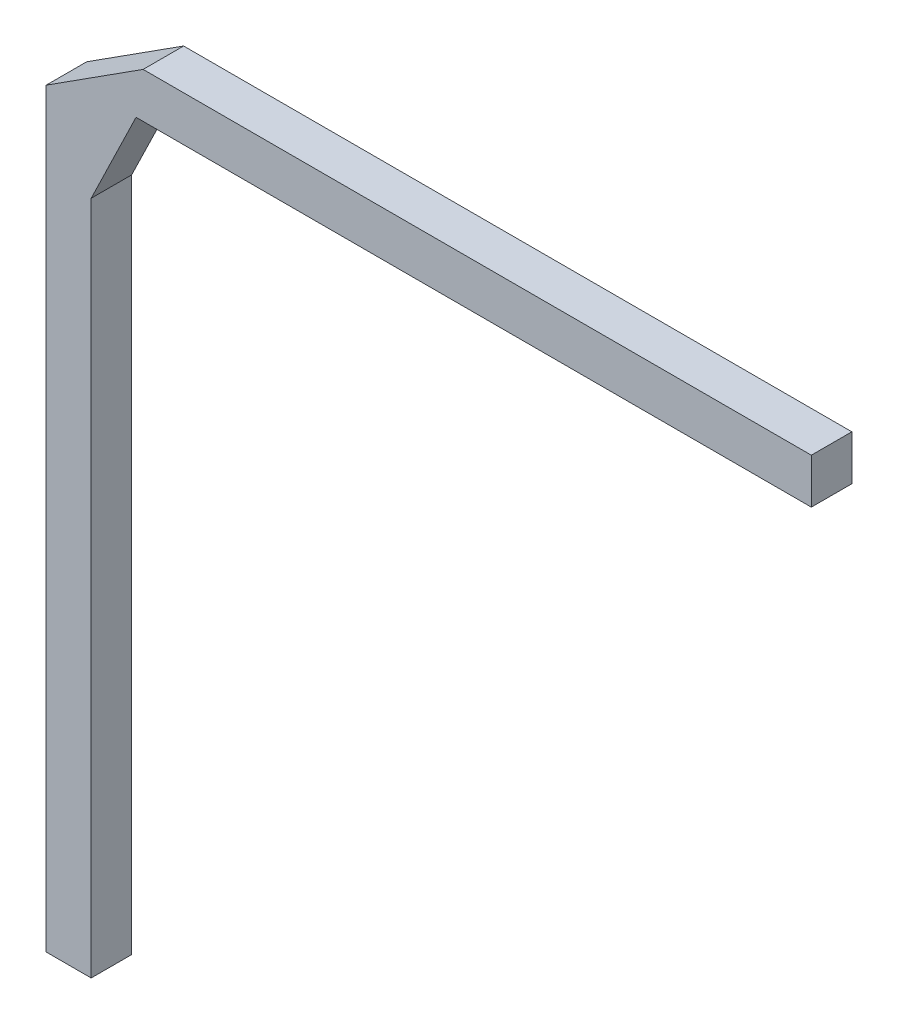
ISO-10303-21;
HEADER;
FILE_DESCRIPTION(('STEP AP214'),'2;1');
FILE_NAME('part.step','',(''),(''),'','','');
FILE_SCHEMA(('AUTOMOTIVE_DESIGN { 1 0 10303 214 1 1 1 1 }'));
ENDSEC;
DATA;
#1=APPLICATION_CONTEXT('core data for automotive mechanical design processes');
#2=APPLICATION_PROTOCOL_DEFINITION('international standard','automotive_design',2000,#1);
#3=PRODUCT_CONTEXT('',#1,'mechanical');
#4=PRODUCT('Part','Part','',(#3));
#5=PRODUCT_RELATED_PRODUCT_CATEGORY('part','',(#4));
#6=PRODUCT_DEFINITION_FORMATION('','',#4);
#7=PRODUCT_DEFINITION_CONTEXT('part definition',#1,'design');
#8=PRODUCT_DEFINITION('design','',#6,#7);
#9=PRODUCT_DEFINITION_SHAPE('','',#8);
#10=(LENGTH_UNIT() NAMED_UNIT(*) SI_UNIT(.MILLI.,.METRE.));
#11=(NAMED_UNIT(*) PLANE_ANGLE_UNIT() SI_UNIT($,.RADIAN.));
#12=(NAMED_UNIT(*) SI_UNIT($,.STERADIAN.) SOLID_ANGLE_UNIT());
#13=UNCERTAINTY_MEASURE_WITH_UNIT(LENGTH_MEASURE(1.E-05),#10,'distance_accuracy_value','');
#14=(GEOMETRIC_REPRESENTATION_CONTEXT(3) GLOBAL_UNCERTAINTY_ASSIGNED_CONTEXT((#13)) GLOBAL_UNIT_ASSIGNED_CONTEXT((#10,
#11,#12)) REPRESENTATION_CONTEXT('',''));
#15=CARTESIAN_POINT('',(0.,0.,0.));
#16=DIRECTION('',(0.,0.,1.));
#17=DIRECTION('',(1.,0.,0.));
#18=AXIS2_PLACEMENT_3D('',#15,#16,#17);
#19=CARTESIAN_POINT('',(7.95384926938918,14.8754782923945,0.9));
#20=DIRECTION('',(1.,0.,0.));
#21=DIRECTION('',(0.,1.,0.));
#22=AXIS2_PLACEMENT_3D('',#19,#20,#21);
#23=PLANE('',#22);
#24=DIRECTION('',(0.,-1.,0.));
#25=VECTOR('',#24,1.);
#26=CARTESIAN_POINT('',(7.95384926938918,14.8754782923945,0.));
#27=LINE('',#26,#25);
#28=CARTESIAN_POINT('',(7.95384926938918,14.8754782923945,0.));
#29=VERTEX_POINT('',#28);
#30=CARTESIAN_POINT('',(7.95384926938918,-1.8,0.));
#31=VERTEX_POINT('',#30);
#32=EDGE_CURVE('E141',#29,#31,#27,.T.);
#33=ORIENTED_EDGE('',*,*,#32,.T.);
#34=DIRECTION('',(0.,0.,-1.));
#35=VECTOR('',#34,1.);
#36=CARTESIAN_POINT('',(7.95384926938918,-1.8,0.9));
#37=LINE('',#36,#35);
#38=CARTESIAN_POINT('',(7.95384926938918,-1.8,0.9));
#39=VERTEX_POINT('',#38);
#40=EDGE_CURVE('E11',#39,#31,#37,.T.);
#41=ORIENTED_EDGE('',*,*,#40,.F.);
#42=DIRECTION('',(0.,-1.,0.));
#43=VECTOR('',#42,1.);
#44=CARTESIAN_POINT('',(7.95384926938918,14.8754782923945,0.9));
#45=LINE('',#44,#43);
#46=CARTESIAN_POINT('',(7.95384926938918,14.8754782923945,0.9));
#47=VERTEX_POINT('',#46);
#48=EDGE_CURVE('E163',#47,#39,#45,.T.);
#49=ORIENTED_EDGE('',*,*,#48,.F.);
#50=DIRECTION('',(0.,0.,-1.));
#51=VECTOR('',#50,1.);
#52=CARTESIAN_POINT('',(7.95384926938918,14.8754782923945,0.9));
#53=LINE('',#52,#51);
#54=EDGE_CURVE('E137',#47,#29,#53,.T.);
#55=ORIENTED_EDGE('',*,*,#54,.T.);
#56=EDGE_LOOP('',(#33,#41,#49,#55));
#57=FACE_BOUND('',#56,.T.);
#58=ADVANCED_FACE('F38',(#57),#23,.F.);
#59=CARTESIAN_POINT('',(7.95384926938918,-1.8,0.9));
#60=DIRECTION('',(0.,1.,0.));
#61=DIRECTION('',(0.,0.,1.));
#62=AXIS2_PLACEMENT_3D('',#59,#60,#61);
#63=PLANE('',#62);
#64=DIRECTION('',(1.,0.,0.));
#65=VECTOR('',#64,1.);
#66=CARTESIAN_POINT('',(7.95384926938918,-1.8,0.));
#67=LINE('',#66,#65);
#68=CARTESIAN_POINT('',(8.95384926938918,-1.8,0.));
#69=VERTEX_POINT('',#68);
#70=EDGE_CURVE('E145',#31,#69,#67,.T.);
#71=ORIENTED_EDGE('',*,*,#70,.T.);
#72=DIRECTION('',(0.,0.,-1.));
#73=VECTOR('',#72,1.);
#74=CARTESIAN_POINT('',(8.95384926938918,-1.8,0.9));
#75=LINE('',#74,#73);
#76=CARTESIAN_POINT('',(8.95384926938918,-1.8,0.9));
#77=VERTEX_POINT('',#76);
#78=EDGE_CURVE('E47',#77,#69,#75,.T.);
#79=ORIENTED_EDGE('',*,*,#78,.F.);
#80=DIRECTION('',(1.,0.,0.));
#81=VECTOR('',#80,1.);
#82=CARTESIAN_POINT('',(7.95384926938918,-1.8,0.9));
#83=LINE('',#82,#81);
#84=EDGE_CURVE('E98',#39,#77,#83,.T.);
#85=ORIENTED_EDGE('',*,*,#84,.F.);
#86=ORIENTED_EDGE('',*,*,#40,.T.);
#87=EDGE_LOOP('',(#71,#79,#85,#86));
#88=FACE_BOUND('',#87,.T.);
#89=ADVANCED_FACE('F207',(#88),#63,.F.);
#90=CARTESIAN_POINT('',(8.95384926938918,-1.8,0.9));
#91=DIRECTION('',(-1.,0.,0.));
#92=DIRECTION('',(0.,0.,1.));
#93=AXIS2_PLACEMENT_3D('',#90,#91,#92);
#94=PLANE('',#93);
#95=DIRECTION('',(0.,1.,0.));
#96=VECTOR('',#95,1.);
#97=CARTESIAN_POINT('',(8.95384926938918,-1.8,0.));
#98=LINE('',#97,#96);
#99=CARTESIAN_POINT('',(8.95384926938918,13.2,0.));
#100=VERTEX_POINT('',#99);
#101=EDGE_CURVE('E148',#69,#100,#98,.T.);
#102=ORIENTED_EDGE('',*,*,#101,.T.);
#103=DIRECTION('',(0.,0.,-1.));
#104=VECTOR('',#103,1.);
#105=CARTESIAN_POINT('',(8.95384926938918,13.2,0.9));
#106=LINE('',#105,#104);
#107=CARTESIAN_POINT('',(8.95384926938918,13.2,0.9));
#108=VERTEX_POINT('',#107);
#109=EDGE_CURVE('E172',#108,#100,#106,.T.);
#110=ORIENTED_EDGE('',*,*,#109,.F.);
#111=DIRECTION('',(0.,1.,0.));
#112=VECTOR('',#111,1.);
#113=CARTESIAN_POINT('',(8.95384926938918,-1.8,0.9));
#114=LINE('',#113,#112);
#115=EDGE_CURVE('E183',#77,#108,#114,.T.);
#116=ORIENTED_EDGE('',*,*,#115,.F.);
#117=ORIENTED_EDGE('',*,*,#78,.T.);
#118=EDGE_LOOP('',(#102,#110,#116,#117));
#119=FACE_BOUND('',#118,.T.);
#120=ADVANCED_FACE('F181',(#119),#94,.F.);
#121=CARTESIAN_POINT('',(8.95384926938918,13.2,0.9));
#122=DIRECTION('',(-0.8997865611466,0.436330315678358,0.));
#123=DIRECTION('',(-0.436330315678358,-0.8997865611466,0.));
#124=AXIS2_PLACEMENT_3D('',#121,#122,#123);
#125=PLANE('',#124);
#126=DIRECTION('',(0.436330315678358,0.8997865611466,0.));
#127=VECTOR('',#126,1.);
#128=CARTESIAN_POINT('',(8.95384926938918,13.2,0.));
#129=LINE('',#128,#127);
#130=CARTESIAN_POINT('',(9.95081427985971,15.2559096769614,0.));
#131=VERTEX_POINT('',#130);
#132=EDGE_CURVE('E151',#100,#131,#129,.T.);
#133=ORIENTED_EDGE('',*,*,#132,.T.);
#134=DIRECTION('',(0.,0.,-1.));
#135=VECTOR('',#134,1.);
#136=CARTESIAN_POINT('',(9.95081427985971,15.2559096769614,0.9));
#137=LINE('',#136,#135);
#138=CARTESIAN_POINT('',(9.95081427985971,15.2559096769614,0.9));
#139=VERTEX_POINT('',#138);
#140=EDGE_CURVE('E168',#139,#131,#137,.T.);
#141=ORIENTED_EDGE('',*,*,#140,.F.);
#142=DIRECTION('',(0.436330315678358,0.8997865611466,0.));
#143=VECTOR('',#142,1.);
#144=CARTESIAN_POINT('',(8.95384926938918,13.2,0.9));
#145=LINE('',#144,#143);
#146=EDGE_CURVE('E195',#108,#139,#145,.T.);
#147=ORIENTED_EDGE('',*,*,#146,.F.);
#148=ORIENTED_EDGE('',*,*,#109,.T.);
#149=EDGE_LOOP('',(#133,#141,#147,#148));
#150=FACE_BOUND('',#149,.T.);
#151=ADVANCED_FACE('F191',(#150),#125,.F.);
#152=CARTESIAN_POINT('',(9.95081427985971,15.2559096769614,0.9));
#153=DIRECTION('',(0.,1.,0.));
#154=DIRECTION('',(-1.,0.,0.));
#155=AXIS2_PLACEMENT_3D('',#152,#153,#154);
#156=PLANE('',#155);
#157=DIRECTION('',(1.,0.,0.));
#158=VECTOR('',#157,1.);
#159=CARTESIAN_POINT('',(9.95081427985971,15.2559096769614,0.));
#160=LINE('',#159,#158);
#161=CARTESIAN_POINT('',(24.9508142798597,15.2559096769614,0.));
#162=VERTEX_POINT('',#161);
#163=EDGE_CURVE('E154',#131,#162,#160,.T.);
#164=ORIENTED_EDGE('',*,*,#163,.T.);
#165=DIRECTION('',(0.,0.,-1.));
#166=VECTOR('',#165,1.);
#167=CARTESIAN_POINT('',(24.9508142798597,15.2559096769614,0.9));
#168=LINE('',#167,#166);
#169=CARTESIAN_POINT('',(24.9508142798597,15.2559096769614,0.9));
#170=VERTEX_POINT('',#169);
#171=EDGE_CURVE('E128',#170,#162,#168,.T.);
#172=ORIENTED_EDGE('',*,*,#171,.F.);
#173=DIRECTION('',(1.,0.,0.));
#174=VECTOR('',#173,1.);
#175=CARTESIAN_POINT('',(9.95081427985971,15.2559096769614,0.9));
#176=LINE('',#175,#174);
#177=EDGE_CURVE('E117',#139,#170,#176,.T.);
#178=ORIENTED_EDGE('',*,*,#177,.F.);
#179=ORIENTED_EDGE('',*,*,#140,.T.);
#180=EDGE_LOOP('',(#164,#172,#178,#179));
#181=FACE_BOUND('',#180,.T.);
#182=ADVANCED_FACE('F194',(#181),#156,.F.);
#183=CARTESIAN_POINT('',(24.9508142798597,15.2559096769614,0.9));
#184=DIRECTION('',(-1.,0.,0.));
#185=DIRECTION('',(0.,0.,1.));
#186=AXIS2_PLACEMENT_3D('',#183,#184,#185);
#187=PLANE('',#186);
#188=DIRECTION('',(0.,1.,0.));
#189=VECTOR('',#188,1.);
#190=CARTESIAN_POINT('',(24.9508142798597,15.2559096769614,0.));
#191=LINE('',#190,#189);
#192=CARTESIAN_POINT('',(24.9508142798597,16.2559096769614,0.));
#193=VERTEX_POINT('',#192);
#194=EDGE_CURVE('E126',#162,#193,#191,.T.);
#195=ORIENTED_EDGE('',*,*,#194,.T.);
#196=DIRECTION('',(0.,0.,-1.));
#197=VECTOR('',#196,1.);
#198=CARTESIAN_POINT('',(24.9508142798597,16.2559096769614,0.9));
#199=LINE('',#198,#197);
#200=CARTESIAN_POINT('',(24.9508142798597,16.2559096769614,0.9));
#201=VERTEX_POINT('',#200);
#202=EDGE_CURVE('E123',#201,#193,#199,.T.);
#203=ORIENTED_EDGE('',*,*,#202,.F.);
#204=DIRECTION('',(0.,1.,0.));
#205=VECTOR('',#204,1.);
#206=CARTESIAN_POINT('',(24.9508142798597,15.2559096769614,0.9));
#207=LINE('',#206,#205);
#208=EDGE_CURVE('E111',#170,#201,#207,.T.);
#209=ORIENTED_EDGE('',*,*,#208,.F.);
#210=ORIENTED_EDGE('',*,*,#171,.T.);
#211=EDGE_LOOP('',(#195,#203,#209,#210));
#212=FACE_BOUND('',#211,.T.);
#213=ADVANCED_FACE('F124',(#212),#187,.F.);
#214=CARTESIAN_POINT('',(24.9508142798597,16.2559096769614,0.9));
#215=DIRECTION('',(0.,-1.,0.));
#216=DIRECTION('',(1.,0.,0.));
#217=AXIS2_PLACEMENT_3D('',#214,#215,#216);
#218=PLANE('',#217);
#219=DIRECTION('',(-1.,0.,0.));
#220=VECTOR('',#219,1.);
#221=CARTESIAN_POINT('',(24.9508142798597,16.2559096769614,0.));
#222=LINE('',#221,#220);
#223=CARTESIAN_POINT('',(10.1079068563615,16.2559096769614,0.));
#224=VERTEX_POINT('',#223);
#225=EDGE_CURVE('E84',#193,#224,#222,.T.);
#226=ORIENTED_EDGE('',*,*,#225,.T.);
#227=DIRECTION('',(0.,0.,-1.));
#228=VECTOR('',#227,1.);
#229=CARTESIAN_POINT('',(10.1079068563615,16.2559096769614,0.9));
#230=LINE('',#229,#228);
#231=CARTESIAN_POINT('',(10.1079068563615,16.2559096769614,0.9));
#232=VERTEX_POINT('',#231);
#233=EDGE_CURVE('E129',#232,#224,#230,.T.);
#234=ORIENTED_EDGE('',*,*,#233,.F.);
#235=DIRECTION('',(-1.,0.,0.));
#236=VECTOR('',#235,1.);
#237=CARTESIAN_POINT('',(24.9508142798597,16.2559096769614,0.9));
#238=LINE('',#237,#236);
#239=EDGE_CURVE('E115',#201,#232,#238,.T.);
#240=ORIENTED_EDGE('',*,*,#239,.F.);
#241=ORIENTED_EDGE('',*,*,#202,.T.);
#242=EDGE_LOOP('',(#226,#234,#240,#241));
#243=FACE_BOUND('',#242,.T.);
#244=ADVANCED_FACE('F131',(#243),#218,.F.);
#245=CARTESIAN_POINT('',(10.1079068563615,16.2559096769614,0.9));
#246=DIRECTION('',(0.539562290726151,-0.841945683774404,0.));
#247=DIRECTION('',(0.841945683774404,0.539562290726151,0.));
#248=AXIS2_PLACEMENT_3D('',#245,#246,#247);
#249=PLANE('',#248);
#250=DIRECTION('',(-0.841945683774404,-0.539562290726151,0.));
#251=VECTOR('',#250,1.);
#252=CARTESIAN_POINT('',(10.1079068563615,16.2559096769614,0.));
#253=LINE('',#252,#251);
#254=EDGE_CURVE('E90',#224,#29,#253,.T.);
#255=ORIENTED_EDGE('',*,*,#254,.T.);
#256=ORIENTED_EDGE('',*,*,#54,.F.);
#257=DIRECTION('',(-0.841945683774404,-0.539562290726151,0.));
#258=VECTOR('',#257,1.);
#259=CARTESIAN_POINT('',(10.1079068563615,16.2559096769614,0.9));
#260=LINE('',#259,#258);
#261=EDGE_CURVE('E55',#232,#47,#260,.T.);
#262=ORIENTED_EDGE('',*,*,#261,.F.);
#263=ORIENTED_EDGE('',*,*,#233,.T.);
#264=EDGE_LOOP('',(#255,#256,#262,#263));
#265=FACE_BOUND('',#264,.T.);
#266=ADVANCED_FACE('F223',(#265),#249,.F.);
#267=CARTESIAN_POINT('',(0.,0.,0.9));
#268=DIRECTION('',(0.,0.,1.));
#269=DIRECTION('',(1.,0.,0.));
#270=AXIS2_PLACEMENT_3D('',#267,#268,#269);
#271=PLANE('',#270);
#272=ORIENTED_EDGE('',*,*,#48,.T.);
#273=ORIENTED_EDGE('',*,*,#84,.T.);
#274=ORIENTED_EDGE('',*,*,#115,.T.);
#275=ORIENTED_EDGE('',*,*,#146,.T.);
#276=ORIENTED_EDGE('',*,*,#177,.T.);
#277=ORIENTED_EDGE('',*,*,#208,.T.);
#278=ORIENTED_EDGE('',*,*,#239,.T.);
#279=ORIENTED_EDGE('',*,*,#261,.T.);
#280=EDGE_LOOP('',(#272,#273,#274,#275,#276,#277,#278,#279));
#281=FACE_BOUND('',#280,.T.);
#282=ADVANCED_FACE('F113',(#281),#271,.T.);
#283=CARTESIAN_POINT('',(0.,0.,0.));
#284=DIRECTION('',(0.,0.,1.));
#285=DIRECTION('',(1.,0.,0.));
#286=AXIS2_PLACEMENT_3D('',#283,#284,#285);
#287=PLANE('',#286);
#288=ORIENTED_EDGE('',*,*,#32,.F.);
#289=ORIENTED_EDGE('',*,*,#254,.F.);
#290=ORIENTED_EDGE('',*,*,#225,.F.);
#291=ORIENTED_EDGE('',*,*,#194,.F.);
#292=ORIENTED_EDGE('',*,*,#163,.F.);
#293=ORIENTED_EDGE('',*,*,#132,.F.);
#294=ORIENTED_EDGE('',*,*,#101,.F.);
#295=ORIENTED_EDGE('',*,*,#70,.F.);
#296=EDGE_LOOP('',(#288,#289,#290,#291,#292,#293,#294,#295));
#297=FACE_BOUND('',#296,.T.);
#298=ADVANCED_FACE('F187',(#297),#287,.F.);
#299=CLOSED_SHELL('',(#58,#89,#120,#151,#182,#213,#244,#266,#282,#298));
#300=MANIFOLD_SOLID_BREP('B2',#299);
#301=ADVANCED_BREP_SHAPE_REPRESENTATION('',(#18,#300),#14);
#302=SHAPE_DEFINITION_REPRESENTATION(#9,#301);
ENDSEC;
END-ISO-10303-21;
